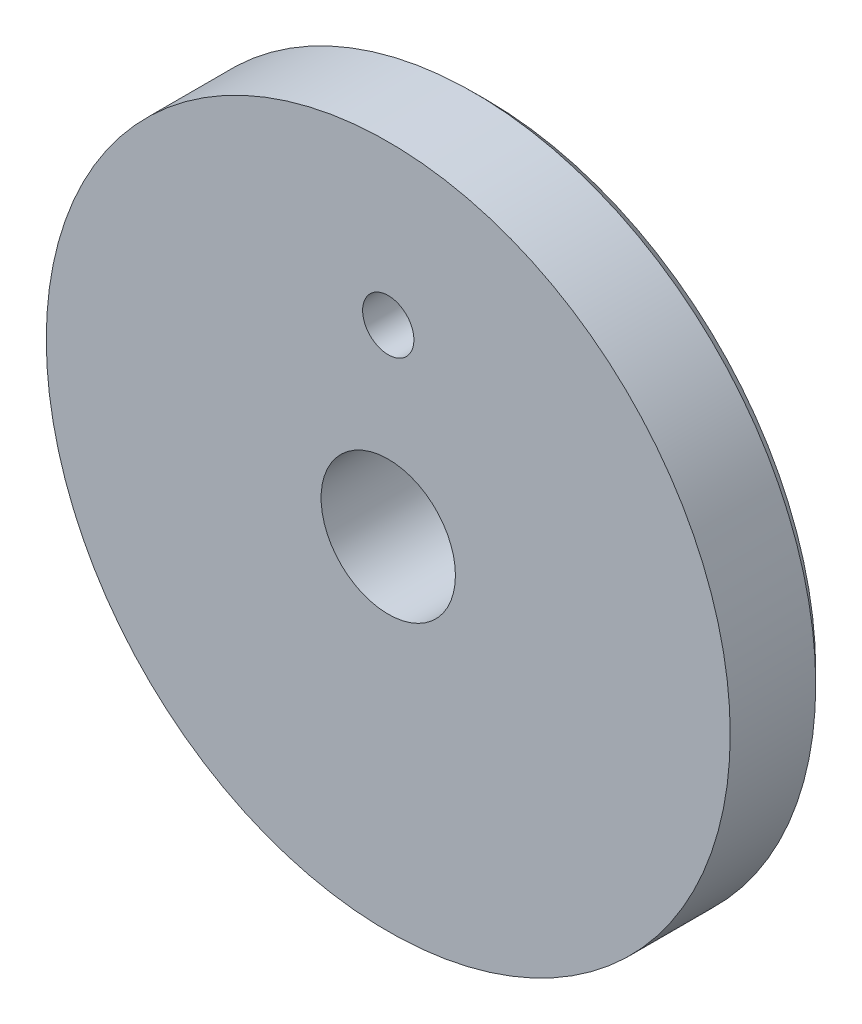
from build123d import *

# Parameters (mm, degrees)
SKETCH1_R          = 14
SKETCH1_R_2        = 2.75
BASE_EXTRUDE_DEPTH = 4
SKETCH2_R          = 1.05
HOLE_DEPTH         = 26.935042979
CHAMFER1_SIZE      = 0.5


with BuildPart() as part:
    # Sketch1 → Base-Extrude (new body)
    with BuildSketch(Plane.XY):
        Circle(SKETCH1_R)
        Circle(SKETCH1_R_2, mode=Mode.SUBTRACT)
    extrude(amount=-BASE_EXTRUDE_DEPTH)

    # Sketch2 → Hole (cut, through all)
    with BuildSketch(Plane(origin=(7.249160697, 0.321299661, -4), x_dir=(-1, 0, 0), z_dir=(0, 0, -1))):
        with Locations((7.249160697, 7.178700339)):
            Circle(SKETCH2_R)
    extrude(amount=-HOLE_DEPTH, mode=Mode.SUBTRACT)

    # Chamfer1
    chamfer1_edges = [part.edges().sort_by_distance(p)[0] for p in [
        (-14, 0, -4),
    ]]
    chamfer(chamfer1_edges, length=CHAMFER1_SIZE)


solid = part.part
